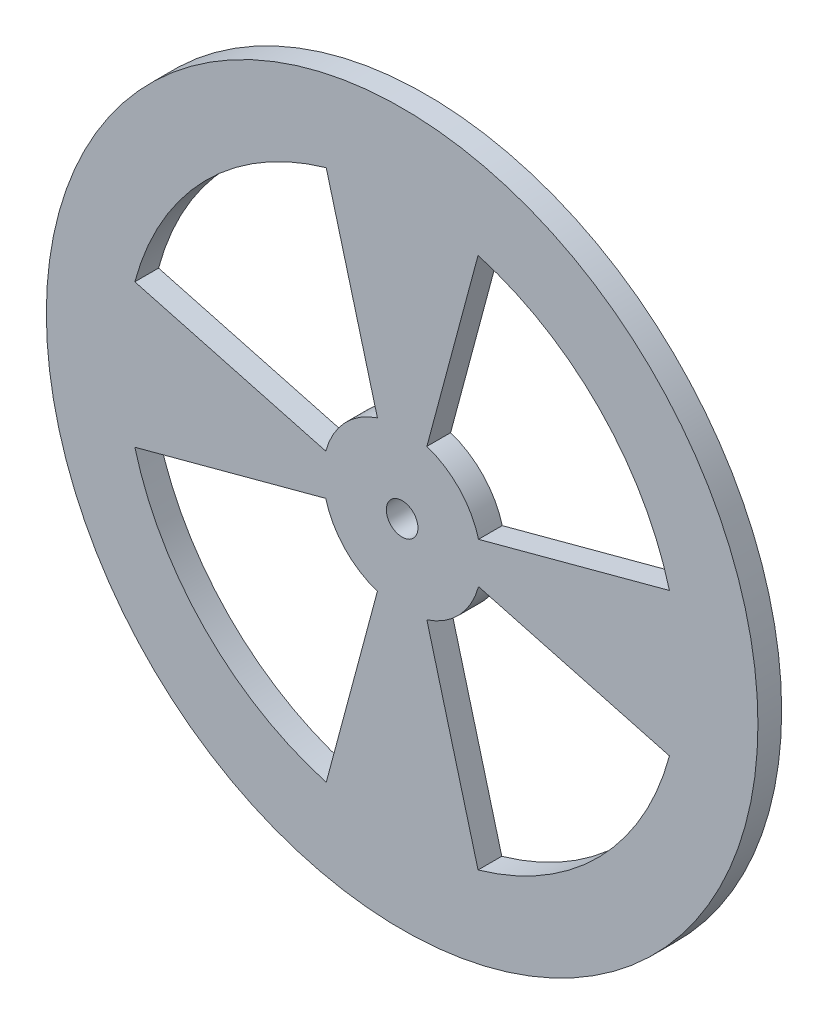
ISO-10303-21;
HEADER;
FILE_DESCRIPTION(('STEP AP214'),'2;1');
FILE_NAME('part.step','',(''),(''),'','','');
FILE_SCHEMA(('AUTOMOTIVE_DESIGN { 1 0 10303 214 1 1 1 1 }'));
ENDSEC;
DATA;
#1=APPLICATION_CONTEXT('core data for automotive mechanical design processes');
#2=APPLICATION_PROTOCOL_DEFINITION('international standard','automotive_design',2000,#1);
#3=PRODUCT_CONTEXT('',#1,'mechanical');
#4=PRODUCT('Part','Part','',(#3));
#5=PRODUCT_RELATED_PRODUCT_CATEGORY('part','',(#4));
#6=PRODUCT_DEFINITION_FORMATION('','',#4);
#7=PRODUCT_DEFINITION_CONTEXT('part definition',#1,'design');
#8=PRODUCT_DEFINITION('design','',#6,#7);
#9=PRODUCT_DEFINITION_SHAPE('','',#8);
#10=(LENGTH_UNIT() NAMED_UNIT(*) SI_UNIT(.MILLI.,.METRE.));
#11=(NAMED_UNIT(*) PLANE_ANGLE_UNIT() SI_UNIT($,.RADIAN.));
#12=(NAMED_UNIT(*) SI_UNIT($,.STERADIAN.) SOLID_ANGLE_UNIT());
#13=UNCERTAINTY_MEASURE_WITH_UNIT(LENGTH_MEASURE(1.E-05),#10,'distance_accuracy_value','');
#14=(GEOMETRIC_REPRESENTATION_CONTEXT(3) GLOBAL_UNCERTAINTY_ASSIGNED_CONTEXT((#13)) GLOBAL_UNIT_ASSIGNED_CONTEXT((#10,
#11,#12)) REPRESENTATION_CONTEXT('',''));
#15=CARTESIAN_POINT('',(0.,0.,0.));
#16=DIRECTION('',(0.,0.,1.));
#17=DIRECTION('',(1.,0.,0.));
#18=AXIS2_PLACEMENT_3D('',#15,#16,#17);
#19=CARTESIAN_POINT('',(-0.543627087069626,-0.145664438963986,3.));
#20=DIRECTION('',(0.96592582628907,0.258819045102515,0.));
#21=DIRECTION('',(-0.258819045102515,0.96592582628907,0.));
#22=AXIS2_PLACEMENT_3D('',#19,#20,#21);
#23=PLANE('',#22);
#24=DIRECTION('',(0.258819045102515,-0.96592582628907,0.));
#25=VECTOR('',#24,1.);
#26=CARTESIAN_POINT('',(-0.543627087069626,-0.145664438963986,0.));
#27=LINE('',#26,#25);
#28=CARTESIAN_POINT('',(-9.60112243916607,33.6573684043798,0.));
#29=VERTEX_POINT('',#28);
#30=CARTESIAN_POINT('',(-3.12771525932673,9.49828391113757,0.));
#31=VERTEX_POINT('',#30);
#32=EDGE_CURVE('E218',#29,#31,#27,.T.);
#33=ORIENTED_EDGE('',*,*,#32,.T.);
#34=DIRECTION('',(0.,0.,-1.));
#35=VECTOR('',#34,1.);
#36=CARTESIAN_POINT('',(-3.12771525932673,9.49828391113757,3.));
#37=LINE('',#36,#35);
#38=CARTESIAN_POINT('',(-3.12771525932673,9.49828391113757,3.));
#39=VERTEX_POINT('',#38);
#40=EDGE_CURVE('E11',#39,#31,#37,.T.);
#41=ORIENTED_EDGE('',*,*,#40,.F.);
#42=DIRECTION('',(0.258819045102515,-0.96592582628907,0.));
#43=VECTOR('',#42,1.);
#44=CARTESIAN_POINT('',(-0.543627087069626,-0.145664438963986,3.));
#45=LINE('',#44,#43);
#46=CARTESIAN_POINT('',(-9.60112243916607,33.6573684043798,3.));
#47=VERTEX_POINT('',#46);
#48=EDGE_CURVE('E161',#47,#39,#45,.T.);
#49=ORIENTED_EDGE('',*,*,#48,.F.);
#50=DIRECTION('',(0.,0.,-1.));
#51=VECTOR('',#50,1.);
#52=CARTESIAN_POINT('',(-9.60112243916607,33.6573684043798,3.));
#53=LINE('',#52,#51);
#54=EDGE_CURVE('E52',#47,#29,#53,.T.);
#55=ORIENTED_EDGE('',*,*,#54,.T.);
#56=EDGE_LOOP('',(#33,#41,#49,#55));
#57=FACE_BOUND('',#56,.T.);
#58=ADVANCED_FACE('F33',(#57),#23,.F.);
#59=CARTESIAN_POINT('',(0.,0.,3.));
#60=DIRECTION('',(0.,0.,-1.));
#61=DIRECTION('',(-1.,0.,0.));
#62=AXIS2_PLACEMENT_3D('',#59,#60,#61);
#63=CYLINDRICAL_SURFACE('',#62,10.);
#64=CARTESIAN_POINT('',(0.,0.,0.));
#65=DIRECTION('',(0.,0.,1.));
#66=DIRECTION('',(1.,0.,0.));
#67=AXIS2_PLACEMENT_3D('',#64,#65,#66);
#68=CIRCLE('',#67,10.);
#69=CARTESIAN_POINT('',(-9.65925826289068,2.58819045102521,0.));
#70=VERTEX_POINT('',#69);
#71=EDGE_CURVE('E169',#31,#70,#68,.T.);
#72=ORIENTED_EDGE('',*,*,#71,.T.);
#73=DIRECTION('',(0.,0.,-1.));
#74=VECTOR('',#73,1.);
#75=CARTESIAN_POINT('',(-9.65925826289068,2.58819045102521,3.));
#76=LINE('',#75,#74);
#77=CARTESIAN_POINT('',(-9.65925826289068,2.58819045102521,3.));
#78=VERTEX_POINT('',#77);
#79=EDGE_CURVE('E43',#78,#70,#76,.T.);
#80=ORIENTED_EDGE('',*,*,#79,.F.);
#81=CARTESIAN_POINT('',(0.,0.,3.));
#82=DIRECTION('',(0.,0.,1.));
#83=DIRECTION('',(1.,0.,0.));
#84=AXIS2_PLACEMENT_3D('',#81,#82,#83);
#85=CIRCLE('',#84,10.);
#86=EDGE_CURVE('E154',#39,#78,#85,.T.);
#87=ORIENTED_EDGE('',*,*,#86,.F.);
#88=ORIENTED_EDGE('',*,*,#40,.T.);
#89=EDGE_LOOP('',(#72,#80,#87,#88));
#90=FACE_BOUND('',#89,.T.);
#91=ADVANCED_FACE('F168',(#90),#63,.T.);
#92=CARTESIAN_POINT('',(0.,0.,3.));
#93=DIRECTION('',(-0.258819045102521,-0.965925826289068,0.));
#94=DIRECTION('',(0.965925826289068,-0.258819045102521,0.));
#95=AXIS2_PLACEMENT_3D('',#92,#93,#94);
#96=PLANE('',#95);
#97=DIRECTION('',(-0.965925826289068,0.258819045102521,0.));
#98=VECTOR('',#97,1.);
#99=CARTESIAN_POINT('',(0.,0.,0.));
#100=LINE('',#99,#98);
#101=CARTESIAN_POINT('',(-33.8074039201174,9.05866657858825,0.));
#102=VERTEX_POINT('',#101);
#103=EDGE_CURVE('E220',#70,#102,#100,.T.);
#104=ORIENTED_EDGE('',*,*,#103,.T.);
#105=DIRECTION('',(0.,0.,-1.));
#106=VECTOR('',#105,1.);
#107=CARTESIAN_POINT('',(-33.8074039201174,9.05866657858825,3.));
#108=LINE('',#107,#106);
#109=CARTESIAN_POINT('',(-33.8074039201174,9.05866657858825,3.));
#110=VERTEX_POINT('',#109);
#111=EDGE_CURVE('E103',#110,#102,#108,.T.);
#112=ORIENTED_EDGE('',*,*,#111,.F.);
#113=DIRECTION('',(-0.965925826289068,0.258819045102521,0.));
#114=VECTOR('',#113,1.);
#115=CARTESIAN_POINT('',(0.,0.,3.));
#116=LINE('',#115,#114);
#117=EDGE_CURVE('E160',#78,#110,#116,.T.);
#118=ORIENTED_EDGE('',*,*,#117,.F.);
#119=ORIENTED_EDGE('',*,*,#79,.T.);
#120=EDGE_LOOP('',(#104,#112,#118,#119));
#121=FACE_BOUND('',#120,.T.);
#122=ADVANCED_FACE('F173',(#121),#96,.F.);
#123=CARTESIAN_POINT('',(0.,0.,3.));
#124=DIRECTION('',(-0.258819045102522,0.965925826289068,0.));
#125=DIRECTION('',(-0.965925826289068,-0.258819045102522,0.));
#126=AXIS2_PLACEMENT_3D('',#123,#124,#125);
#127=PLANE('',#126);
#128=DIRECTION('',(0.965925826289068,0.258819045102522,0.));
#129=VECTOR('',#128,1.);
#130=CARTESIAN_POINT('',(0.,0.,0.));
#131=LINE('',#130,#129);
#132=CARTESIAN_POINT('',(9.65925826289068,2.58819045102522,0.));
#133=VERTEX_POINT('',#132);
#134=CARTESIAN_POINT('',(33.8074039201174,9.05866657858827,0.));
#135=VERTEX_POINT('',#134);
#136=EDGE_CURVE('E210',#133,#135,#131,.T.);
#137=ORIENTED_EDGE('',*,*,#136,.F.);
#138=DIRECTION('',(0.,0.,-1.));
#139=VECTOR('',#138,1.);
#140=CARTESIAN_POINT('',(9.65925826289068,2.58819045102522,3.));
#141=LINE('',#140,#139);
#142=CARTESIAN_POINT('',(9.65925826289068,2.58819045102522,3.));
#143=VERTEX_POINT('',#142);
#144=EDGE_CURVE('E230',#143,#133,#141,.T.);
#145=ORIENTED_EDGE('',*,*,#144,.F.);
#146=DIRECTION('',(0.965925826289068,0.258819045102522,0.));
#147=VECTOR('',#146,1.);
#148=CARTESIAN_POINT('',(0.,0.,3.));
#149=LINE('',#148,#147);
#150=CARTESIAN_POINT('',(33.8074039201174,9.05866657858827,3.));
#151=VERTEX_POINT('',#150);
#152=EDGE_CURVE('E442',#143,#151,#149,.T.);
#153=ORIENTED_EDGE('',*,*,#152,.T.);
#154=DIRECTION('',(0.,0.,-1.));
#155=VECTOR('',#154,1.);
#156=CARTESIAN_POINT('',(33.8074039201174,9.05866657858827,3.));
#157=LINE('',#156,#155);
#158=EDGE_CURVE('E232',#151,#135,#157,.T.);
#159=ORIENTED_EDGE('',*,*,#158,.T.);
#160=EDGE_LOOP('',(#137,#145,#153,#159));
#161=FACE_BOUND('',#160,.T.);
#162=ADVANCED_FACE('F295',(#161),#127,.T.);
#163=CARTESIAN_POINT('',(3.12771525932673,9.49828391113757,0.));
#164=VERTEX_POINT('',#163);
#165=EDGE_CURVE('E213',#133,#164,#68,.T.);
#166=ORIENTED_EDGE('',*,*,#165,.T.);
#167=DIRECTION('',(0.,0.,-1.));
#168=VECTOR('',#167,1.);
#169=CARTESIAN_POINT('',(3.12771525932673,9.49828391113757,3.));
#170=LINE('',#169,#168);
#171=CARTESIAN_POINT('',(3.12771525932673,9.49828391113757,3.));
#172=VERTEX_POINT('',#171);
#173=EDGE_CURVE('E237',#172,#164,#170,.T.);
#174=ORIENTED_EDGE('',*,*,#173,.F.);
#175=EDGE_CURVE('E165',#143,#172,#85,.T.);
#176=ORIENTED_EDGE('',*,*,#175,.F.);
#177=ORIENTED_EDGE('',*,*,#144,.T.);
#178=EDGE_LOOP('',(#166,#174,#176,#177));
#179=FACE_BOUND('',#178,.T.);
#180=ADVANCED_FACE('F287',(#179),#63,.T.);
#181=CARTESIAN_POINT('',(0.543627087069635,-0.145664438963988,3.));
#182=DIRECTION('',(0.96592582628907,-0.258819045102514,0.));
#183=DIRECTION('',(0.258819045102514,0.96592582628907,0.));
#184=AXIS2_PLACEMENT_3D('',#181,#182,#183);
#185=PLANE('',#184);
#186=DIRECTION('',(-0.258819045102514,-0.96592582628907,0.));
#187=VECTOR('',#186,1.);
#188=CARTESIAN_POINT('',(0.543627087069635,-0.145664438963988,0.));
#189=LINE('',#188,#187);
#190=CARTESIAN_POINT('',(9.60112243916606,33.6573684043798,0.));
#191=VERTEX_POINT('',#190);
#192=EDGE_CURVE('E214',#191,#164,#189,.T.);
#193=ORIENTED_EDGE('',*,*,#192,.F.);
#194=DIRECTION('',(0.,0.,-1.));
#195=VECTOR('',#194,1.);
#196=CARTESIAN_POINT('',(9.60112243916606,33.6573684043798,3.));
#197=LINE('',#196,#195);
#198=CARTESIAN_POINT('',(9.60112243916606,33.6573684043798,3.));
#199=VERTEX_POINT('',#198);
#200=EDGE_CURVE('E234',#199,#191,#197,.T.);
#201=ORIENTED_EDGE('',*,*,#200,.F.);
#202=DIRECTION('',(-0.258819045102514,-0.96592582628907,0.));
#203=VECTOR('',#202,1.);
#204=CARTESIAN_POINT('',(0.543627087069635,-0.145664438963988,3.));
#205=LINE('',#204,#203);
#206=EDGE_CURVE('E437',#199,#172,#205,.T.);
#207=ORIENTED_EDGE('',*,*,#206,.T.);
#208=ORIENTED_EDGE('',*,*,#173,.T.);
#209=EDGE_LOOP('',(#193,#201,#207,#208));
#210=FACE_BOUND('',#209,.T.);
#211=ADVANCED_FACE('F290',(#210),#185,.T.);
#212=CARTESIAN_POINT('',(0.54362708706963,0.145664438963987,3.));
#213=DIRECTION('',(-0.96592582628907,-0.258819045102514,0.));
#214=DIRECTION('',(0.258819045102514,-0.96592582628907,0.));
#215=AXIS2_PLACEMENT_3D('',#212,#213,#214);
#216=PLANE('',#215);
#217=DIRECTION('',(-0.258819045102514,0.96592582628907,0.));
#218=VECTOR('',#217,1.);
#219=CARTESIAN_POINT('',(0.54362708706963,0.145664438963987,0.));
#220=LINE('',#219,#218);
#221=CARTESIAN_POINT('',(9.60112243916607,-33.6573684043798,0.));
#222=VERTEX_POINT('',#221);
#223=CARTESIAN_POINT('',(3.12771525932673,-9.49828391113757,0.));
#224=VERTEX_POINT('',#223);
#225=EDGE_CURVE('E202',#222,#224,#220,.T.);
#226=ORIENTED_EDGE('',*,*,#225,.T.);
#227=DIRECTION('',(0.,0.,-1.));
#228=VECTOR('',#227,1.);
#229=CARTESIAN_POINT('',(3.12771525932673,-9.49828391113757,3.));
#230=LINE('',#229,#228);
#231=CARTESIAN_POINT('',(3.12771525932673,-9.49828391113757,3.));
#232=VERTEX_POINT('',#231);
#233=EDGE_CURVE('E235',#232,#224,#230,.T.);
#234=ORIENTED_EDGE('',*,*,#233,.F.);
#235=DIRECTION('',(-0.258819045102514,0.96592582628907,0.));
#236=VECTOR('',#235,1.);
#237=CARTESIAN_POINT('',(0.54362708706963,0.145664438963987,3.));
#238=LINE('',#237,#236);
#239=CARTESIAN_POINT('',(9.60112243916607,-33.6573684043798,3.));
#240=VERTEX_POINT('',#239);
#241=EDGE_CURVE('E449',#240,#232,#238,.T.);
#242=ORIENTED_EDGE('',*,*,#241,.F.);
#243=DIRECTION('',(0.,0.,-1.));
#244=VECTOR('',#243,1.);
#245=CARTESIAN_POINT('',(9.60112243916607,-33.6573684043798,3.));
#246=LINE('',#245,#244);
#247=EDGE_CURVE('E240',#240,#222,#246,.T.);
#248=ORIENTED_EDGE('',*,*,#247,.T.);
#249=EDGE_LOOP('',(#226,#234,#242,#248));
#250=FACE_BOUND('',#249,.T.);
#251=ADVANCED_FACE('F293',(#250),#216,.F.);
#252=CARTESIAN_POINT('',(9.65925826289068,-2.58819045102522,0.));
#253=VERTEX_POINT('',#252);
#254=EDGE_CURVE('E196',#224,#253,#68,.T.);
#255=ORIENTED_EDGE('',*,*,#254,.T.);
#256=DIRECTION('',(0.,0.,-1.));
#257=VECTOR('',#256,1.);
#258=CARTESIAN_POINT('',(9.65925826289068,-2.58819045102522,3.));
#259=LINE('',#258,#257);
#260=CARTESIAN_POINT('',(9.65925826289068,-2.58819045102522,3.));
#261=VERTEX_POINT('',#260);
#262=EDGE_CURVE('E244',#261,#253,#259,.T.);
#263=ORIENTED_EDGE('',*,*,#262,.F.);
#264=EDGE_CURVE('E443',#232,#261,#85,.T.);
#265=ORIENTED_EDGE('',*,*,#264,.F.);
#266=ORIENTED_EDGE('',*,*,#233,.T.);
#267=EDGE_LOOP('',(#255,#263,#265,#266));
#268=FACE_BOUND('',#267,.T.);
#269=ADVANCED_FACE('F280',(#268),#63,.T.);
#270=CARTESIAN_POINT('',(0.,0.,3.));
#271=DIRECTION('',(0.258819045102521,0.965925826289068,0.));
#272=DIRECTION('',(-0.965925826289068,0.258819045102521,0.));
#273=AXIS2_PLACEMENT_3D('',#270,#271,#272);
#274=PLANE('',#273);
#275=DIRECTION('',(0.965925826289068,-0.258819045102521,0.));
#276=VECTOR('',#275,1.);
#277=CARTESIAN_POINT('',(0.,0.,0.));
#278=LINE('',#277,#276);
#279=CARTESIAN_POINT('',(33.8074039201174,-9.05866657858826,0.));
#280=VERTEX_POINT('',#279);
#281=EDGE_CURVE('E207',#253,#280,#278,.T.);
#282=ORIENTED_EDGE('',*,*,#281,.T.);
#283=DIRECTION('',(0.,0.,-1.));
#284=VECTOR('',#283,1.);
#285=CARTESIAN_POINT('',(33.8074039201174,-9.05866657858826,3.));
#286=LINE('',#285,#284);
#287=CARTESIAN_POINT('',(33.8074039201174,-9.05866657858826,3.));
#288=VERTEX_POINT('',#287);
#289=EDGE_CURVE('E242',#288,#280,#286,.T.);
#290=ORIENTED_EDGE('',*,*,#289,.F.);
#291=DIRECTION('',(0.965925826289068,-0.258819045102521,0.));
#292=VECTOR('',#291,1.);
#293=CARTESIAN_POINT('',(0.,0.,3.));
#294=LINE('',#293,#292);
#295=EDGE_CURVE('E447',#261,#288,#294,.T.);
#296=ORIENTED_EDGE('',*,*,#295,.F.);
#297=ORIENTED_EDGE('',*,*,#262,.T.);
#298=EDGE_LOOP('',(#282,#290,#296,#297));
#299=FACE_BOUND('',#298,.T.);
#300=ADVANCED_FACE('F299',(#299),#274,.F.);
#301=CARTESIAN_POINT('',(0.,0.,3.));
#302=DIRECTION('',(0.258819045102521,-0.965925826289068,0.));
#303=DIRECTION('',(0.965925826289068,0.258819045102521,0.));
#304=AXIS2_PLACEMENT_3D('',#301,#302,#303);
#305=PLANE('',#304);
#306=DIRECTION('',(-0.965925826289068,-0.258819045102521,0.));
#307=VECTOR('',#306,1.);
#308=CARTESIAN_POINT('',(0.,0.,0.));
#309=LINE('',#308,#307);
#310=CARTESIAN_POINT('',(-9.65925826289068,-2.58819045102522,0.));
#311=VERTEX_POINT('',#310);
#312=CARTESIAN_POINT('',(-33.8074039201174,-9.05866657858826,0.));
#313=VERTEX_POINT('',#312);
#314=EDGE_CURVE('E189',#311,#313,#309,.T.);
#315=ORIENTED_EDGE('',*,*,#314,.F.);
#316=DIRECTION('',(0.,0.,-1.));
#317=VECTOR('',#316,1.);
#318=CARTESIAN_POINT('',(-9.65925826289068,-2.58819045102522,3.));
#319=LINE('',#318,#317);
#320=CARTESIAN_POINT('',(-9.65925826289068,-2.58819045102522,3.));
#321=VERTEX_POINT('',#320);
#322=EDGE_CURVE('E37',#321,#311,#319,.T.);
#323=ORIENTED_EDGE('',*,*,#322,.F.);
#324=DIRECTION('',(-0.965925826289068,-0.258819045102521,0.));
#325=VECTOR('',#324,1.);
#326=CARTESIAN_POINT('',(0.,0.,3.));
#327=LINE('',#326,#325);
#328=CARTESIAN_POINT('',(-33.8074039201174,-9.05866657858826,3.));
#329=VERTEX_POINT('',#328);
#330=EDGE_CURVE('E228',#321,#329,#327,.T.);
#331=ORIENTED_EDGE('',*,*,#330,.T.);
#332=DIRECTION('',(0.,0.,-1.));
#333=VECTOR('',#332,1.);
#334=CARTESIAN_POINT('',(-33.8074039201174,-9.05866657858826,3.));
#335=LINE('',#334,#333);
#336=EDGE_CURVE('E188',#329,#313,#335,.T.);
#337=ORIENTED_EDGE('',*,*,#336,.T.);
#338=EDGE_LOOP('',(#315,#323,#331,#337));
#339=FACE_BOUND('',#338,.T.);
#340=ADVANCED_FACE('F35',(#339),#305,.T.);
#341=CARTESIAN_POINT('',(-3.12771525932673,-9.49828391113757,0.));
#342=VERTEX_POINT('',#341);
#343=EDGE_CURVE('E192',#311,#342,#68,.T.);
#344=ORIENTED_EDGE('',*,*,#343,.T.);
#345=DIRECTION('',(0.,0.,-1.));
#346=VECTOR('',#345,1.);
#347=CARTESIAN_POINT('',(-3.12771525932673,-9.49828391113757,3.));
#348=LINE('',#347,#346);
#349=CARTESIAN_POINT('',(-3.12771525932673,-9.49828391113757,3.));
#350=VERTEX_POINT('',#349);
#351=EDGE_CURVE('E251',#350,#342,#348,.T.);
#352=ORIENTED_EDGE('',*,*,#351,.F.);
#353=EDGE_CURVE('E166',#321,#350,#85,.T.);
#354=ORIENTED_EDGE('',*,*,#353,.F.);
#355=ORIENTED_EDGE('',*,*,#322,.T.);
#356=EDGE_LOOP('',(#344,#352,#354,#355));
#357=FACE_BOUND('',#356,.T.);
#358=ADVANCED_FACE('F258',(#357),#63,.T.);
#359=CARTESIAN_POINT('',(-0.54362708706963,0.145664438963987,3.));
#360=DIRECTION('',(-0.96592582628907,0.258819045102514,0.));
#361=DIRECTION('',(-0.258819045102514,-0.96592582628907,0.));
#362=AXIS2_PLACEMENT_3D('',#359,#360,#361);
#363=PLANE('',#362);
#364=DIRECTION('',(0.258819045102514,0.96592582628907,0.));
#365=VECTOR('',#364,1.);
#366=CARTESIAN_POINT('',(-0.54362708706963,0.145664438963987,0.));
#367=LINE('',#366,#365);
#368=CARTESIAN_POINT('',(-9.60112243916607,-33.6573684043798,0.));
#369=VERTEX_POINT('',#368);
#370=EDGE_CURVE('E195',#369,#342,#367,.T.);
#371=ORIENTED_EDGE('',*,*,#370,.F.);
#372=DIRECTION('',(0.,0.,-1.));
#373=VECTOR('',#372,1.);
#374=CARTESIAN_POINT('',(-9.60112243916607,-33.6573684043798,3.));
#375=LINE('',#374,#373);
#376=CARTESIAN_POINT('',(-9.60112243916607,-33.6573684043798,3.));
#377=VERTEX_POINT('',#376);
#378=EDGE_CURVE('E250',#377,#369,#375,.T.);
#379=ORIENTED_EDGE('',*,*,#378,.F.);
#380=DIRECTION('',(0.258819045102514,0.96592582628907,0.));
#381=VECTOR('',#380,1.);
#382=CARTESIAN_POINT('',(-0.54362708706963,0.145664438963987,3.));
#383=LINE('',#382,#381);
#384=EDGE_CURVE('E452',#377,#350,#383,.T.);
#385=ORIENTED_EDGE('',*,*,#384,.T.);
#386=ORIENTED_EDGE('',*,*,#351,.T.);
#387=EDGE_LOOP('',(#371,#379,#385,#386));
#388=FACE_BOUND('',#387,.T.);
#389=ADVANCED_FACE('F269',(#388),#363,.T.);
#390=CARTESIAN_POINT('',(0.,0.,3.));
#391=DIRECTION('',(0.,0.,-1.));
#392=DIRECTION('',(-1.,0.,0.));
#393=AXIS2_PLACEMENT_3D('',#390,#391,#392);
#394=CYLINDRICAL_SURFACE('',#393,45.);
#395=CARTESIAN_POINT('',(0.,0.,3.));
#396=DIRECTION('',(0.,0.,1.));
#397=DIRECTION('',(1.,0.,0.));
#398=AXIS2_PLACEMENT_3D('',#395,#396,#397);
#399=CIRCLE('',#398,45.);
#400=CARTESIAN_POINT('',(45.,0.,3.));
#401=VERTEX_POINT('',#400);
#402=EDGE_CURVE('E176',#401,#401,#399,.T.);
#403=ORIENTED_EDGE('',*,*,#402,.F.);
#404=EDGE_LOOP('',(#403));
#405=FACE_BOUND('',#404,.T.);
#406=CARTESIAN_POINT('',(0.,0.,0.));
#407=DIRECTION('',(0.,0.,1.));
#408=DIRECTION('',(1.,0.,0.));
#409=AXIS2_PLACEMENT_3D('',#406,#407,#408);
#410=CIRCLE('',#409,45.);
#411=CARTESIAN_POINT('',(45.,0.,0.));
#412=VERTEX_POINT('',#411);
#413=EDGE_CURVE('E222',#412,#412,#410,.T.);
#414=ORIENTED_EDGE('',*,*,#413,.T.);
#415=EDGE_LOOP('',(#414));
#416=FACE_BOUND('',#415,.T.);
#417=ADVANCED_FACE('F271',(#405,#416),#394,.T.);
#418=CARTESIAN_POINT('',(0.,0.,3.));
#419=DIRECTION('',(0.,0.,-1.));
#420=DIRECTION('',(-1.,0.,0.));
#421=AXIS2_PLACEMENT_3D('',#418,#419,#420);
#422=CYLINDRICAL_SURFACE('',#421,35.);
#423=CARTESIAN_POINT('',(0.,0.,0.));
#424=DIRECTION('',(0.,0.,1.));
#425=DIRECTION('',(1.,0.,0.));
#426=AXIS2_PLACEMENT_3D('',#423,#424,#425);
#427=CIRCLE('',#426,35.);
#428=EDGE_CURVE('E203',#29,#102,#427,.T.);
#429=ORIENTED_EDGE('',*,*,#428,.F.);
#430=ORIENTED_EDGE('',*,*,#54,.F.);
#431=CARTESIAN_POINT('',(0.,0.,3.));
#432=DIRECTION('',(0.,0.,1.));
#433=DIRECTION('',(1.,0.,0.));
#434=AXIS2_PLACEMENT_3D('',#431,#432,#433);
#435=CIRCLE('',#434,35.);
#436=EDGE_CURVE('E174',#47,#110,#435,.T.);
#437=ORIENTED_EDGE('',*,*,#436,.T.);
#438=ORIENTED_EDGE('',*,*,#111,.T.);
#439=EDGE_LOOP('',(#429,#430,#437,#438));
#440=FACE_BOUND('',#439,.T.);
#441=ADVANCED_FACE('F276',(#440),#422,.F.);
#442=EDGE_CURVE('E217',#135,#191,#427,.T.);
#443=ORIENTED_EDGE('',*,*,#442,.F.);
#444=ORIENTED_EDGE('',*,*,#158,.F.);
#445=EDGE_CURVE('E178',#151,#199,#435,.T.);
#446=ORIENTED_EDGE('',*,*,#445,.T.);
#447=ORIENTED_EDGE('',*,*,#200,.T.);
#448=EDGE_LOOP('',(#443,#444,#446,#447));
#449=FACE_BOUND('',#448,.T.);
#450=ADVANCED_FACE('F325',(#449),#422,.F.);
#451=EDGE_CURVE('E204',#222,#280,#427,.T.);
#452=ORIENTED_EDGE('',*,*,#451,.F.);
#453=ORIENTED_EDGE('',*,*,#247,.F.);
#454=EDGE_CURVE('E441',#240,#288,#435,.T.);
#455=ORIENTED_EDGE('',*,*,#454,.T.);
#456=ORIENTED_EDGE('',*,*,#289,.T.);
#457=EDGE_LOOP('',(#452,#453,#455,#456));
#458=FACE_BOUND('',#457,.T.);
#459=ADVANCED_FACE('F316',(#458),#422,.F.);
#460=EDGE_CURVE('E199',#313,#369,#427,.T.);
#461=ORIENTED_EDGE('',*,*,#460,.F.);
#462=ORIENTED_EDGE('',*,*,#336,.F.);
#463=EDGE_CURVE('E179',#329,#377,#435,.T.);
#464=ORIENTED_EDGE('',*,*,#463,.T.);
#465=ORIENTED_EDGE('',*,*,#378,.T.);
#466=EDGE_LOOP('',(#461,#462,#464,#465));
#467=FACE_BOUND('',#466,.T.);
#468=ADVANCED_FACE('F267',(#467),#422,.F.);
#469=CARTESIAN_POINT('',(0.,0.,3.));
#470=DIRECTION('',(0.,0.,-1.));
#471=DIRECTION('',(-1.,0.,0.));
#472=AXIS2_PLACEMENT_3D('',#469,#470,#471);
#473=CYLINDRICAL_SURFACE('',#472,2.);
#474=CARTESIAN_POINT('',(0.,0.,3.));
#475=DIRECTION('',(0.,0.,1.));
#476=DIRECTION('',(1.,0.,0.));
#477=AXIS2_PLACEMENT_3D('',#474,#475,#476);
#478=CIRCLE('',#477,2.);
#479=CARTESIAN_POINT('',(2.,0.,3.));
#480=VERTEX_POINT('',#479);
#481=EDGE_CURVE('E185',#480,#480,#478,.T.);
#482=ORIENTED_EDGE('',*,*,#481,.T.);
#483=EDGE_LOOP('',(#482));
#484=FACE_BOUND('',#483,.T.);
#485=CARTESIAN_POINT('',(0.,0.,0.));
#486=DIRECTION('',(0.,0.,1.));
#487=DIRECTION('',(1.,0.,0.));
#488=AXIS2_PLACEMENT_3D('',#485,#486,#487);
#489=CIRCLE('',#488,2.);
#490=CARTESIAN_POINT('',(2.,0.,0.));
#491=VERTEX_POINT('',#490);
#492=EDGE_CURVE('E225',#491,#491,#489,.T.);
#493=ORIENTED_EDGE('',*,*,#492,.F.);
#494=EDGE_LOOP('',(#493));
#495=FACE_BOUND('',#494,.T.);
#496=ADVANCED_FACE('F332',(#484,#495),#473,.F.);
#497=CARTESIAN_POINT('',(0.,0.,3.));
#498=DIRECTION('',(0.,0.,1.));
#499=DIRECTION('',(1.,0.,0.));
#500=AXIS2_PLACEMENT_3D('',#497,#498,#499);
#501=PLANE('',#500);
#502=ORIENTED_EDGE('',*,*,#330,.F.);
#503=ORIENTED_EDGE('',*,*,#353,.T.);
#504=ORIENTED_EDGE('',*,*,#384,.F.);
#505=ORIENTED_EDGE('',*,*,#463,.F.);
#506=EDGE_LOOP('',(#502,#503,#504,#505));
#507=FACE_BOUND('',#506,.T.);
#508=ORIENTED_EDGE('',*,*,#241,.T.);
#509=ORIENTED_EDGE('',*,*,#264,.T.);
#510=ORIENTED_EDGE('',*,*,#295,.T.);
#511=ORIENTED_EDGE('',*,*,#454,.F.);
#512=EDGE_LOOP('',(#508,#509,#510,#511));
#513=FACE_BOUND('',#512,.T.);
#514=ORIENTED_EDGE('',*,*,#152,.F.);
#515=ORIENTED_EDGE('',*,*,#175,.T.);
#516=ORIENTED_EDGE('',*,*,#206,.F.);
#517=ORIENTED_EDGE('',*,*,#445,.F.);
#518=EDGE_LOOP('',(#514,#515,#516,#517));
#519=FACE_BOUND('',#518,.T.);
#520=ORIENTED_EDGE('',*,*,#48,.T.);
#521=ORIENTED_EDGE('',*,*,#86,.T.);
#522=ORIENTED_EDGE('',*,*,#117,.T.);
#523=ORIENTED_EDGE('',*,*,#436,.F.);
#524=EDGE_LOOP('',(#520,#521,#522,#523));
#525=FACE_BOUND('',#524,.T.);
#526=ORIENTED_EDGE('',*,*,#402,.T.);
#527=EDGE_LOOP('',(#526));
#528=FACE_BOUND('',#527,.T.);
#529=ORIENTED_EDGE('',*,*,#481,.F.);
#530=EDGE_LOOP('',(#529));
#531=FACE_BOUND('',#530,.T.);
#532=ADVANCED_FACE('F156',(#507,#513,#519,#525,#528,#531),#501,.T.);
#533=CARTESIAN_POINT('',(0.,0.,0.));
#534=DIRECTION('',(0.,0.,1.));
#535=DIRECTION('',(1.,0.,0.));
#536=AXIS2_PLACEMENT_3D('',#533,#534,#535);
#537=PLANE('',#536);
#538=ORIENTED_EDGE('',*,*,#314,.T.);
#539=ORIENTED_EDGE('',*,*,#460,.T.);
#540=ORIENTED_EDGE('',*,*,#370,.T.);
#541=ORIENTED_EDGE('',*,*,#343,.F.);
#542=EDGE_LOOP('',(#538,#539,#540,#541));
#543=FACE_BOUND('',#542,.T.);
#544=ORIENTED_EDGE('',*,*,#225,.F.);
#545=ORIENTED_EDGE('',*,*,#451,.T.);
#546=ORIENTED_EDGE('',*,*,#281,.F.);
#547=ORIENTED_EDGE('',*,*,#254,.F.);
#548=EDGE_LOOP('',(#544,#545,#546,#547));
#549=FACE_BOUND('',#548,.T.);
#550=ORIENTED_EDGE('',*,*,#136,.T.);
#551=ORIENTED_EDGE('',*,*,#442,.T.);
#552=ORIENTED_EDGE('',*,*,#192,.T.);
#553=ORIENTED_EDGE('',*,*,#165,.F.);
#554=EDGE_LOOP('',(#550,#551,#552,#553));
#555=FACE_BOUND('',#554,.T.);
#556=ORIENTED_EDGE('',*,*,#32,.F.);
#557=ORIENTED_EDGE('',*,*,#428,.T.);
#558=ORIENTED_EDGE('',*,*,#103,.F.);
#559=ORIENTED_EDGE('',*,*,#71,.F.);
#560=EDGE_LOOP('',(#556,#557,#558,#559));
#561=FACE_BOUND('',#560,.T.);
#562=ORIENTED_EDGE('',*,*,#413,.F.);
#563=EDGE_LOOP('',(#562));
#564=FACE_BOUND('',#563,.T.);
#565=ORIENTED_EDGE('',*,*,#492,.T.);
#566=EDGE_LOOP('',(#565));
#567=FACE_BOUND('',#566,.T.);
#568=ADVANCED_FACE('F261',(#543,#549,#555,#561,#564,#567),#537,.F.);
#569=CLOSED_SHELL('',(#58,#91,#122,#162,#180,#211,#251,#269,#300,#340,#358,#389,#417,#441,#450,
#459,#468,#496,#532,#568));
#570=MANIFOLD_SOLID_BREP('B2',#569);
#571=ADVANCED_BREP_SHAPE_REPRESENTATION('',(#18,#570),#14);
#572=SHAPE_DEFINITION_REPRESENTATION(#9,#571);
ENDSEC;
END-ISO-10303-21;
